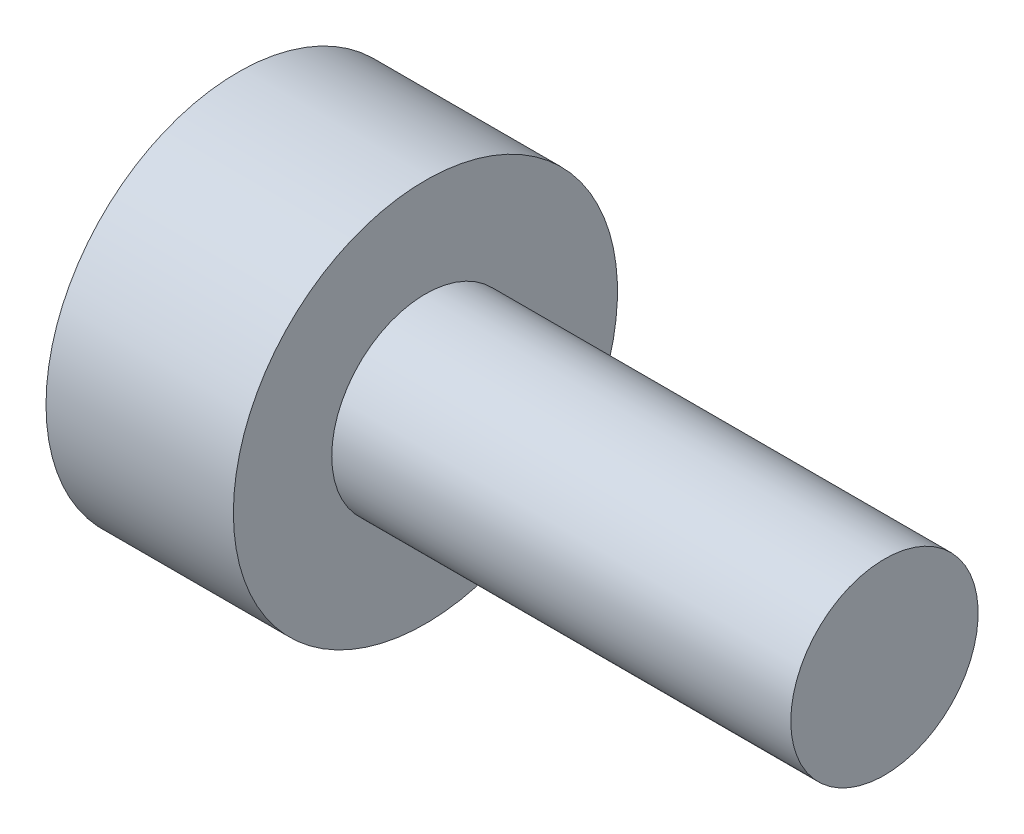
ISO-10303-21;
HEADER;
FILE_DESCRIPTION(('STEP AP214'),'2;1');
FILE_NAME('part.step','',(''),(''),'','','');
FILE_SCHEMA(('AUTOMOTIVE_DESIGN { 1 0 10303 214 1 1 1 1 }'));
ENDSEC;
DATA;
#1=APPLICATION_CONTEXT('core data for automotive mechanical design processes');
#2=APPLICATION_PROTOCOL_DEFINITION('international standard','automotive_design',2000,#1);
#3=PRODUCT_CONTEXT('',#1,'mechanical');
#4=PRODUCT('Part','Part','',(#3));
#5=PRODUCT_RELATED_PRODUCT_CATEGORY('part','',(#4));
#6=PRODUCT_DEFINITION_FORMATION('','',#4);
#7=PRODUCT_DEFINITION_CONTEXT('part definition',#1,'design');
#8=PRODUCT_DEFINITION('design','',#6,#7);
#9=PRODUCT_DEFINITION_SHAPE('','',#8);
#10=(LENGTH_UNIT() NAMED_UNIT(*) SI_UNIT(.MILLI.,.METRE.));
#11=(NAMED_UNIT(*) PLANE_ANGLE_UNIT() SI_UNIT($,.RADIAN.));
#12=(NAMED_UNIT(*) SI_UNIT($,.STERADIAN.) SOLID_ANGLE_UNIT());
#13=UNCERTAINTY_MEASURE_WITH_UNIT(LENGTH_MEASURE(1.E-05),#10,'distance_accuracy_value','');
#14=(GEOMETRIC_REPRESENTATION_CONTEXT(3) GLOBAL_UNCERTAINTY_ASSIGNED_CONTEXT((#13)) GLOBAL_UNIT_ASSIGNED_CONTEXT((#10,
#11,#12)) REPRESENTATION_CONTEXT('',''));
#15=CARTESIAN_POINT('',(0.,0.,0.));
#16=DIRECTION('',(0.,0.,1.));
#17=DIRECTION('',(1.,0.,0.));
#18=AXIS2_PLACEMENT_3D('',#15,#16,#17);
#19=CARTESIAN_POINT('',(0.,0.,0.));
#20=DIRECTION('',(1.,0.,0.));
#21=DIRECTION('',(0.,0.,-1.));
#22=AXIS2_PLACEMENT_3D('',#19,#20,#21);
#23=PLANE('',#22);
#24=CARTESIAN_POINT('',(0.,0.,0.));
#25=DIRECTION('',(-1.,0.,0.));
#26=DIRECTION('',(0.,0.,1.));
#27=AXIS2_PLACEMENT_3D('',#24,#25,#26);
#28=CIRCLE('',#27,0.15);
#29=CARTESIAN_POINT('',(0.,0.,0.15));
#30=VERTEX_POINT('',#29);
#31=EDGE_CURVE('E36',#30,#30,#28,.T.);
#32=ORIENTED_EDGE('',*,*,#31,.F.);
#33=EDGE_LOOP('',(#32));
#34=FACE_BOUND('',#33,.T.);
#35=CARTESIAN_POINT('',(0.,0.,0.));
#36=DIRECTION('',(-1.,0.,0.));
#37=DIRECTION('',(0.,0.,1.));
#38=AXIS2_PLACEMENT_3D('',#35,#36,#37);
#39=CIRCLE('',#38,4.1);
#40=CARTESIAN_POINT('',(0.,0.,4.1));
#41=VERTEX_POINT('',#40);
#42=EDGE_CURVE('E9',#41,#41,#39,.T.);
#43=ORIENTED_EDGE('',*,*,#42,.T.);
#44=EDGE_LOOP('',(#43));
#45=FACE_BOUND('',#44,.T.);
#46=ADVANCED_FACE('F14',(#34,#45),#23,.F.);
#47=CARTESIAN_POINT('',(0.,0.,0.));
#48=DIRECTION('',(-1.,0.,0.));
#49=DIRECTION('',(0.,0.,1.));
#50=AXIS2_PLACEMENT_3D('',#47,#48,#49);
#51=CYLINDRICAL_SURFACE('',#50,4.1);
#52=ORIENTED_EDGE('',*,*,#42,.F.);
#53=EDGE_LOOP('',(#52));
#54=FACE_BOUND('',#53,.T.);
#55=CARTESIAN_POINT('',(4.,0.,0.));
#56=DIRECTION('',(-1.,0.,0.));
#57=DIRECTION('',(0.,0.,1.));
#58=AXIS2_PLACEMENT_3D('',#55,#56,#57);
#59=CIRCLE('',#58,4.1);
#60=CARTESIAN_POINT('',(4.,0.,4.1));
#61=VERTEX_POINT('',#60);
#62=EDGE_CURVE('E20',#61,#61,#59,.T.);
#63=ORIENTED_EDGE('',*,*,#62,.T.);
#64=EDGE_LOOP('',(#63));
#65=FACE_BOUND('',#64,.T.);
#66=ADVANCED_FACE('F43',(#54,#65),#51,.T.);
#67=CARTESIAN_POINT('',(4.,4.1,0.));
#68=DIRECTION('',(-1.,0.,0.));
#69=DIRECTION('',(0.,0.,1.));
#70=AXIS2_PLACEMENT_3D('',#67,#68,#69);
#71=PLANE('',#70);
#72=ORIENTED_EDGE('',*,*,#62,.F.);
#73=EDGE_LOOP('',(#72));
#74=FACE_BOUND('',#73,.T.);
#75=CARTESIAN_POINT('',(4.,0.,0.));
#76=DIRECTION('',(-1.,0.,0.));
#77=DIRECTION('',(0.,0.,1.));
#78=AXIS2_PLACEMENT_3D('',#75,#76,#77);
#79=CIRCLE('',#78,2.);
#80=CARTESIAN_POINT('',(4.,0.,2.));
#81=VERTEX_POINT('',#80);
#82=EDGE_CURVE('E24',#81,#81,#79,.T.);
#83=ORIENTED_EDGE('',*,*,#82,.T.);
#84=EDGE_LOOP('',(#83));
#85=FACE_BOUND('',#84,.T.);
#86=ADVANCED_FACE('F49',(#74,#85),#71,.F.);
#87=CARTESIAN_POINT('',(0.,0.,0.));
#88=DIRECTION('',(-1.,0.,0.));
#89=DIRECTION('',(0.,0.,1.));
#90=AXIS2_PLACEMENT_3D('',#87,#88,#89);
#91=CYLINDRICAL_SURFACE('',#90,2.);
#92=ORIENTED_EDGE('',*,*,#82,.F.);
#93=EDGE_LOOP('',(#92));
#94=FACE_BOUND('',#93,.T.);
#95=CARTESIAN_POINT('',(13.8,0.,0.));
#96=DIRECTION('',(-1.,0.,0.));
#97=DIRECTION('',(0.,0.,1.));
#98=AXIS2_PLACEMENT_3D('',#95,#96,#97);
#99=CIRCLE('',#98,2.);
#100=CARTESIAN_POINT('',(13.8,0.,2.));
#101=VERTEX_POINT('',#100);
#102=EDGE_CURVE('E28',#101,#101,#99,.T.);
#103=ORIENTED_EDGE('',*,*,#102,.T.);
#104=EDGE_LOOP('',(#103));
#105=FACE_BOUND('',#104,.T.);
#106=ADVANCED_FACE('F55',(#94,#105),#91,.T.);
#107=CARTESIAN_POINT('',(13.8,2.,0.));
#108=DIRECTION('',(-1.,0.,0.));
#109=DIRECTION('',(0.,0.,1.));
#110=AXIS2_PLACEMENT_3D('',#107,#108,#109);
#111=PLANE('',#110);
#112=ORIENTED_EDGE('',*,*,#102,.F.);
#113=EDGE_LOOP('',(#112));
#114=FACE_BOUND('',#113,.T.);
#115=ADVANCED_FACE('F61',(#114),#111,.F.);
#116=CARTESIAN_POINT('',(0.,0.,0.));
#117=DIRECTION('',(-1.,0.,0.));
#118=DIRECTION('',(0.,0.,1.));
#119=AXIS2_PLACEMENT_3D('',#116,#117,#118);
#120=CONICAL_SURFACE('',#119,0.15,0.26179938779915);
#121=CARTESIAN_POINT('',(0.3,0.,0.));
#122=DIRECTION('',(-1.,0.,0.));
#123=DIRECTION('',(0.,0.,1.));
#124=AXIS2_PLACEMENT_3D('',#121,#122,#123);
#125=CIRCLE('',#124,0.069615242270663);
#126=CARTESIAN_POINT('',(0.3,0.,0.069615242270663));
#127=VERTEX_POINT('',#126);
#128=EDGE_CURVE('E33',#127,#127,#125,.T.);
#129=ORIENTED_EDGE('',*,*,#128,.F.);
#130=EDGE_LOOP('',(#129));
#131=FACE_BOUND('',#130,.T.);
#132=ORIENTED_EDGE('',*,*,#31,.T.);
#133=EDGE_LOOP('',(#132));
#134=FACE_BOUND('',#133,.T.);
#135=ADVANCED_FACE('F40',(#131,#134),#120,.F.);
#136=CARTESIAN_POINT('',(0.3,0.,0.));
#137=DIRECTION('',(-1.,0.,0.));
#138=DIRECTION('',(0.,0.,1.));
#139=AXIS2_PLACEMENT_3D('',#136,#137,#138);
#140=PLANE('',#139);
#141=ORIENTED_EDGE('',*,*,#128,.T.);
#142=EDGE_LOOP('',(#141));
#143=FACE_BOUND('',#142,.T.);
#144=ADVANCED_FACE('F68',(#143),#140,.T.);
#145=CLOSED_SHELL('',(#46,#66,#86,#106,#115,#135,#144));
#146=MANIFOLD_SOLID_BREP('B1',#145);
#147=ADVANCED_BREP_SHAPE_REPRESENTATION('',(#18,#146),#14);
#148=SHAPE_DEFINITION_REPRESENTATION(#9,#147);
ENDSEC;
END-ISO-10303-21;
